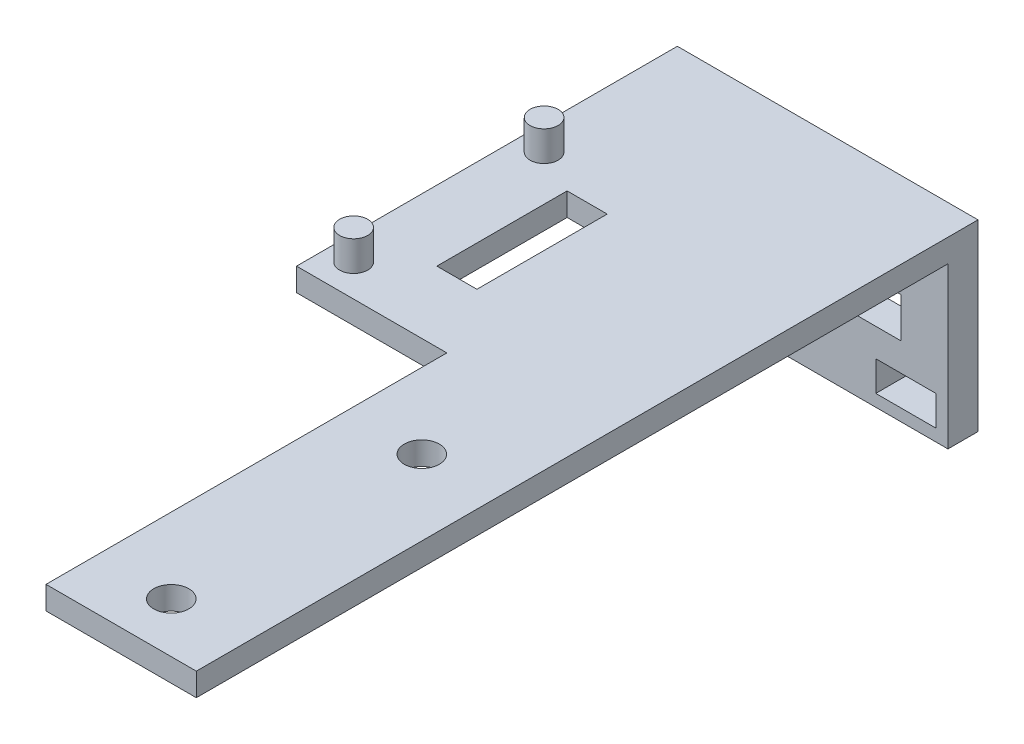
from build123d import *

# Parameters (mm, degrees)
SKETCH_1_R          = 1.75
SKETCH_1_W          = 4
SKETCH_1_H          = 13
EXTRUDE_1_DEPTH     = 2.3
SKETCH_2_R          = 1.4
EXTRUDE_2_DEPTH     = 3
EXTRUDE_START       = -2.3
SKETCH_3_W          = 30
SKETCH_3_H          = 3
EXTRUDE_3_DEPTH     = 16
SKETCH_4_W          = 18
SKETCH_4_H          = 4
SKETCH_4_W_2        = 6
SKETCH_4_H_2        = 3
CUT_EXTRUDE_1_DEPTH = 84.21742606


with BuildPart() as part:
    # Sketch 1 → Extrude 1 (new body)
    with BuildSketch(Plane(origin=(0, 0, 0), x_dir=(1, 0, 0), z_dir=(0, 1, 0))):
        Polygon((-7.5, 7.5), (-7.5, -32.5), (7.5, -32.5), (7.5, 32.5), (7.5, 45.5), (-22.5, 45.5), (-22.5, 32.5), (-22.5, 7.5), align=None)
        with Locations(Location((0, -27.5, 0), (0, 0, 270))):
            Circle(SKETCH_1_R, mode=Mode.SUBTRACT)
        with Locations(Location((0, -2.5, 0), (0, 0, 270))):
            Circle(SKETCH_1_R, mode=Mode.SUBTRACT)
        with Locations((-13.5, 21)):
            Rectangle(SKETCH_1_W, SKETCH_1_H, mode=Mode.SUBTRACT)
    extrude(amount=-EXTRUDE_1_DEPTH)

    # Sketch 2 → Extrude 2 (add)
    with BuildSketch(Plane(origin=(0, 0, 0), x_dir=(1, 0, 0), z_dir=(0, 1, 0))):
        with Locations(Location((-20, 29.7, 0), (0, 0, 270))):
            Circle(SKETCH_2_R)
        with Locations(Location((-20, 10.7, 0), (0, 0, 270))):
            Circle(SKETCH_2_R)
    extrude(amount=EXTRUDE_2_DEPTH)

    # Sketch 3 → Extrude 3 (add)
    with BuildSketch(Plane(origin=(0, 0, 0), x_dir=(1, 0, 0), z_dir=(0, 1, 0)).offset(EXTRUDE_START)):
        with Locations((-7.5, 44)):
            Rectangle(SKETCH_3_W, SKETCH_3_H)
    extrude(amount=-EXTRUDE_3_DEPTH)

    # Sketch 4 → Cut-Extrude 1 (cut, through all)
    with BuildSketch(Plane(origin=(0, 0, -45.5), x_dir=(-1, 0, 0), z_dir=(0, 0, -1))):
        with Locations((6.2, -9.3)):
            Rectangle(SKETCH_4_W, SKETCH_4_H)
        with Locations((-3.3, -15.6)):
            Rectangle(SKETCH_4_W_2, SKETCH_4_H_2)
        with Locations((15.7, -15.6)):
            Rectangle(SKETCH_4_W_2, SKETCH_4_H_2)
    extrude(amount=-CUT_EXTRUDE_1_DEPTH, mode=Mode.SUBTRACT)


solid = part.part
